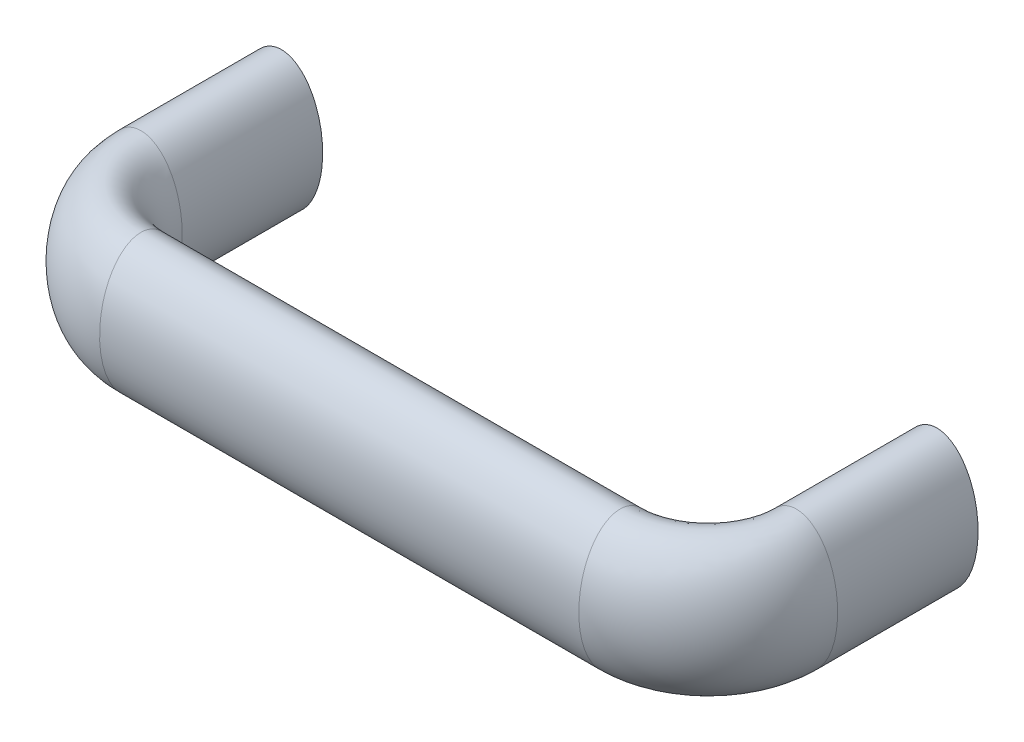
ISO-10303-21;
HEADER;
FILE_DESCRIPTION(('STEP AP214'),'2;1');
FILE_NAME('part.step','',(''),(''),'','','');
FILE_SCHEMA(('AUTOMOTIVE_DESIGN { 1 0 10303 214 1 1 1 1 }'));
ENDSEC;
DATA;
#1=APPLICATION_CONTEXT('core data for automotive mechanical design processes');
#2=APPLICATION_PROTOCOL_DEFINITION('international standard','automotive_design',2000,#1);
#3=PRODUCT_CONTEXT('',#1,'mechanical');
#4=PRODUCT('Part','Part','',(#3));
#5=PRODUCT_RELATED_PRODUCT_CATEGORY('part','',(#4));
#6=PRODUCT_DEFINITION_FORMATION('','',#4);
#7=PRODUCT_DEFINITION_CONTEXT('part definition',#1,'design');
#8=PRODUCT_DEFINITION('design','',#6,#7);
#9=PRODUCT_DEFINITION_SHAPE('','',#8);
#10=(LENGTH_UNIT() NAMED_UNIT(*) SI_UNIT(.MILLI.,.METRE.));
#11=(NAMED_UNIT(*) PLANE_ANGLE_UNIT() SI_UNIT($,.RADIAN.));
#12=(NAMED_UNIT(*) SI_UNIT($,.STERADIAN.) SOLID_ANGLE_UNIT());
#13=UNCERTAINTY_MEASURE_WITH_UNIT(LENGTH_MEASURE(1.E-05),#10,'distance_accuracy_value','');
#14=(GEOMETRIC_REPRESENTATION_CONTEXT(3) GLOBAL_UNCERTAINTY_ASSIGNED_CONTEXT((#13)) GLOBAL_UNIT_ASSIGNED_CONTEXT((#10,
#11,#12)) REPRESENTATION_CONTEXT('',''));
#15=CARTESIAN_POINT('',(0.,0.,0.));
#16=DIRECTION('',(0.,0.,1.));
#17=DIRECTION('',(1.,0.,0.));
#18=AXIS2_PLACEMENT_3D('',#15,#16,#17);
#19=CARTESIAN_POINT('',(118.,0.,25.5));
#20=DIRECTION('',(0.,0.,-1.));
#21=DIRECTION('',(0.,1.,0.));
#22=AXIS2_PLACEMENT_3D('',#19,#20,#21);
#23=ELLIPSE('',#22,12.5,7.5);
#24=DIRECTION('',(0.,0.,-1.));
#25=VECTOR('',#24,1.);
#26=SURFACE_OF_LINEAR_EXTRUSION('',#23,#25);
#27=CARTESIAN_POINT('',(118.,12.5,25.5));
#28=VERTEX_POINT('',#27);
#29=EDGE_CURVE('E18',#28,#28,#23,.T.);
#30=ORIENTED_EDGE('',*,*,#29,.T.);
#31=EDGE_LOOP('',(#30));
#32=FACE_BOUND('',#31,.T.);
#33=CARTESIAN_POINT('',(118.,0.,0.));
#34=DIRECTION('',(0.,0.,-1.));
#35=DIRECTION('',(0.,1.,0.));
#36=AXIS2_PLACEMENT_3D('',#33,#34,#35);
#37=ELLIPSE('',#36,12.5,7.5);
#38=CARTESIAN_POINT('',(118.,12.5,0.));
#39=VERTEX_POINT('',#38);
#40=EDGE_CURVE('E8',#39,#39,#37,.T.);
#41=ORIENTED_EDGE('',*,*,#40,.F.);
#42=EDGE_LOOP('',(#41));
#43=FACE_BOUND('',#42,.T.);
#44=ADVANCED_FACE('F12',(#32,#43),#26,.T.);
#45=CARTESIAN_POINT('',(102.,0.,41.5));
#46=DIRECTION('',(1.,0.,0.));
#47=DIRECTION('',(0.,1.,0.));
#48=AXIS2_PLACEMENT_3D('',#45,#46,#47);
#49=ELLIPSE('',#48,12.5,7.5);
#50=CARTESIAN_POINT('',(102.,0.,25.5));
#51=DIRECTION('',(0.,1.,0.));
#52=AXIS1_PLACEMENT('',#50,#51);
#53=SURFACE_OF_REVOLUTION('',#49,#52);
#54=CARTESIAN_POINT('',(102.,12.5,41.5));
#55=VERTEX_POINT('',#54);
#56=EDGE_CURVE('E22',#55,#55,#49,.T.);
#57=ORIENTED_EDGE('',*,*,#56,.T.);
#58=EDGE_LOOP('',(#57));
#59=FACE_BOUND('',#58,.T.);
#60=ORIENTED_EDGE('',*,*,#29,.F.);
#61=EDGE_LOOP('',(#60));
#62=FACE_BOUND('',#61,.T.);
#63=ADVANCED_FACE('F33',(#59,#62),#53,.F.);
#64=CARTESIAN_POINT('',(14.9999999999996,0.,41.5));
#65=DIRECTION('',(1.,0.,0.));
#66=DIRECTION('',(0.,1.,0.));
#67=AXIS2_PLACEMENT_3D('',#64,#65,#66);
#68=ELLIPSE('',#67,12.5,7.5);
#69=DIRECTION('',(1.,0.,0.));
#70=VECTOR('',#69,1.);
#71=SURFACE_OF_LINEAR_EXTRUSION('',#68,#70);
#72=CARTESIAN_POINT('',(14.9999999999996,12.5,41.5));
#73=VERTEX_POINT('',#72);
#74=EDGE_CURVE('E26',#73,#73,#68,.T.);
#75=ORIENTED_EDGE('',*,*,#74,.T.);
#76=EDGE_LOOP('',(#75));
#77=FACE_BOUND('',#76,.T.);
#78=ORIENTED_EDGE('',*,*,#56,.F.);
#79=EDGE_LOOP('',(#78));
#80=FACE_BOUND('',#79,.T.);
#81=ADVANCED_FACE('F36',(#77,#80),#71,.T.);
#82=CARTESIAN_POINT('',(-1.00000000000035,0.,25.5));
#83=DIRECTION('',(0.,0.,1.));
#84=DIRECTION('',(0.,1.,0.));
#85=AXIS2_PLACEMENT_3D('',#82,#83,#84);
#86=ELLIPSE('',#85,12.5,7.5);
#87=CARTESIAN_POINT('',(14.9999999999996,0.,25.5));
#88=DIRECTION('',(0.,1.,0.));
#89=AXIS1_PLACEMENT('',#87,#88);
#90=SURFACE_OF_REVOLUTION('',#86,#89);
#91=CARTESIAN_POINT('',(-1.00000000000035,12.5,25.5));
#92=VERTEX_POINT('',#91);
#93=EDGE_CURVE('E48',#92,#92,#86,.T.);
#94=ORIENTED_EDGE('',*,*,#93,.T.);
#95=EDGE_LOOP('',(#94));
#96=FACE_BOUND('',#95,.T.);
#97=ORIENTED_EDGE('',*,*,#74,.F.);
#98=EDGE_LOOP('',(#97));
#99=FACE_BOUND('',#98,.T.);
#100=ADVANCED_FACE('F40',(#96,#99),#90,.F.);
#101=DIRECTION('',(0.,0.,-1.));
#102=VECTOR('',#101,1.);
#103=SURFACE_OF_LINEAR_EXTRUSION('',#86,#102);
#104=ORIENTED_EDGE('',*,*,#93,.F.);
#105=EDGE_LOOP('',(#104));
#106=FACE_BOUND('',#105,.T.);
#107=CARTESIAN_POINT('',(-1.00000000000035,0.,0.));
#108=DIRECTION('',(0.,0.,1.));
#109=DIRECTION('',(0.,1.,0.));
#110=AXIS2_PLACEMENT_3D('',#107,#108,#109);
#111=ELLIPSE('',#110,12.5,7.5);
#112=CARTESIAN_POINT('',(-1.00000000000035,12.5,0.));
#113=VERTEX_POINT('',#112);
#114=EDGE_CURVE('E52',#113,#113,#111,.T.);
#115=ORIENTED_EDGE('',*,*,#114,.T.);
#116=EDGE_LOOP('',(#115));
#117=FACE_BOUND('',#116,.T.);
#118=ADVANCED_FACE('F45',(#106,#117),#103,.F.);
#119=CARTESIAN_POINT('',(118.,0.,0.));
#120=DIRECTION('',(0.,0.,-1.));
#121=DIRECTION('',(-1.,0.,0.));
#122=AXIS2_PLACEMENT_3D('',#119,#120,#121);
#123=PLANE('',#122);
#124=CARTESIAN_POINT('',(117.,0.,-3.18210377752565E-12));
#125=DIRECTION('',(0.,0.,-1.));
#126=DIRECTION('',(-1.,0.,0.));
#127=AXIS2_PLACEMENT_3D('',#124,#125,#126);
#128=CIRCLE('',#127,4.);
#129=CARTESIAN_POINT('',(113.,0.,-3.07423585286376E-12));
#130=VERTEX_POINT('',#129);
#131=EDGE_CURVE('E53',#130,#130,#128,.T.);
#132=ORIENTED_EDGE('',*,*,#131,.F.);
#133=EDGE_LOOP('',(#132));
#134=FACE_BOUND('',#133,.T.);
#135=ORIENTED_EDGE('',*,*,#40,.T.);
#136=EDGE_LOOP('',(#135));
#137=FACE_BOUND('',#136,.T.);
#138=ADVANCED_FACE('F85',(#134,#137),#123,.T.);
#139=CARTESIAN_POINT('',(-1.00000000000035,0.,0.));
#140=DIRECTION('',(0.,0.,1.));
#141=DIRECTION('',(1.,0.,0.));
#142=AXIS2_PLACEMENT_3D('',#139,#140,#141);
#143=PLANE('',#142);
#144=CARTESIAN_POINT('',(-3.50630982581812E-13,0.,0.));
#145=DIRECTION('',(0.,0.,-1.));
#146=DIRECTION('',(-1.,0.,0.));
#147=AXIS2_PLACEMENT_3D('',#144,#145,#146);
#148=CIRCLE('',#147,4.);
#149=CARTESIAN_POINT('',(-4.00000000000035,0.,0.));
#150=VERTEX_POINT('',#149);
#151=EDGE_CURVE('E66',#150,#150,#148,.T.);
#152=ORIENTED_EDGE('',*,*,#151,.F.);
#153=EDGE_LOOP('',(#152));
#154=FACE_BOUND('',#153,.T.);
#155=ORIENTED_EDGE('',*,*,#114,.F.);
#156=EDGE_LOOP('',(#155));
#157=FACE_BOUND('',#156,.T.);
#158=ADVANCED_FACE('F81',(#154,#157),#143,.F.);
#159=CARTESIAN_POINT('',(117.,0.,12.9999999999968));
#160=DIRECTION('',(0.,0.,-1.));
#161=DIRECTION('',(-1.,0.,0.));
#162=AXIS2_PLACEMENT_3D('',#159,#160,#161);
#163=CYLINDRICAL_SURFACE('',#162,4.);
#164=CARTESIAN_POINT('',(117.,0.,12.9999999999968));
#165=DIRECTION('',(0.,0.,-1.));
#166=DIRECTION('',(-1.,0.,0.));
#167=AXIS2_PLACEMENT_3D('',#164,#165,#166);
#168=CIRCLE('',#167,4.);
#169=CARTESIAN_POINT('',(113.,0.,12.9999999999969));
#170=VERTEX_POINT('',#169);
#171=EDGE_CURVE('E57',#170,#170,#168,.T.);
#172=ORIENTED_EDGE('',*,*,#171,.F.);
#173=EDGE_LOOP('',(#172));
#174=FACE_BOUND('',#173,.T.);
#175=ORIENTED_EDGE('',*,*,#131,.T.);
#176=EDGE_LOOP('',(#175));
#177=FACE_BOUND('',#176,.T.);
#178=ADVANCED_FACE('F84',(#174,#177),#163,.F.);
#179=CARTESIAN_POINT('',(117.,0.,12.9999999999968));
#180=DIRECTION('',(0.,0.,-1.));
#181=DIRECTION('',(-1.,0.,0.));
#182=AXIS2_PLACEMENT_3D('',#179,#180,#181);
#183=PLANE('',#182);
#184=ORIENTED_EDGE('',*,*,#171,.T.);
#185=EDGE_LOOP('',(#184));
#186=FACE_BOUND('',#185,.T.);
#187=ADVANCED_FACE('F77',(#186),#183,.T.);
#188=CARTESIAN_POINT('',(0.,0.,13.));
#189=DIRECTION('',(0.,0.,-1.));
#190=DIRECTION('',(-1.,0.,0.));
#191=AXIS2_PLACEMENT_3D('',#188,#189,#190);
#192=CYLINDRICAL_SURFACE('',#191,4.);
#193=CARTESIAN_POINT('',(0.,0.,13.));
#194=DIRECTION('',(0.,0.,-1.));
#195=DIRECTION('',(-1.,0.,0.));
#196=AXIS2_PLACEMENT_3D('',#193,#194,#195);
#197=CIRCLE('',#196,4.);
#198=CARTESIAN_POINT('',(-4.,0.,13.0000000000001));
#199=VERTEX_POINT('',#198);
#200=EDGE_CURVE('E64',#199,#199,#197,.T.);
#201=ORIENTED_EDGE('',*,*,#200,.F.);
#202=EDGE_LOOP('',(#201));
#203=FACE_BOUND('',#202,.T.);
#204=ORIENTED_EDGE('',*,*,#151,.T.);
#205=EDGE_LOOP('',(#204));
#206=FACE_BOUND('',#205,.T.);
#207=ADVANCED_FACE('F74',(#203,#206),#192,.F.);
#208=CARTESIAN_POINT('',(0.,0.,13.));
#209=DIRECTION('',(0.,0.,-1.));
#210=DIRECTION('',(-1.,0.,0.));
#211=AXIS2_PLACEMENT_3D('',#208,#209,#210);
#212=PLANE('',#211);
#213=ORIENTED_EDGE('',*,*,#200,.T.);
#214=EDGE_LOOP('',(#213));
#215=FACE_BOUND('',#214,.T.);
#216=ADVANCED_FACE('F72',(#215),#212,.T.);
#217=CLOSED_SHELL('',(#44,#63,#81,#100,#118,#138,#158,#178,#187,#207,#216));
#218=MANIFOLD_SOLID_BREP('B1',#217);
#219=ADVANCED_BREP_SHAPE_REPRESENTATION('',(#18,#218),#14);
#220=SHAPE_DEFINITION_REPRESENTATION(#9,#219);
ENDSEC;
END-ISO-10303-21;
